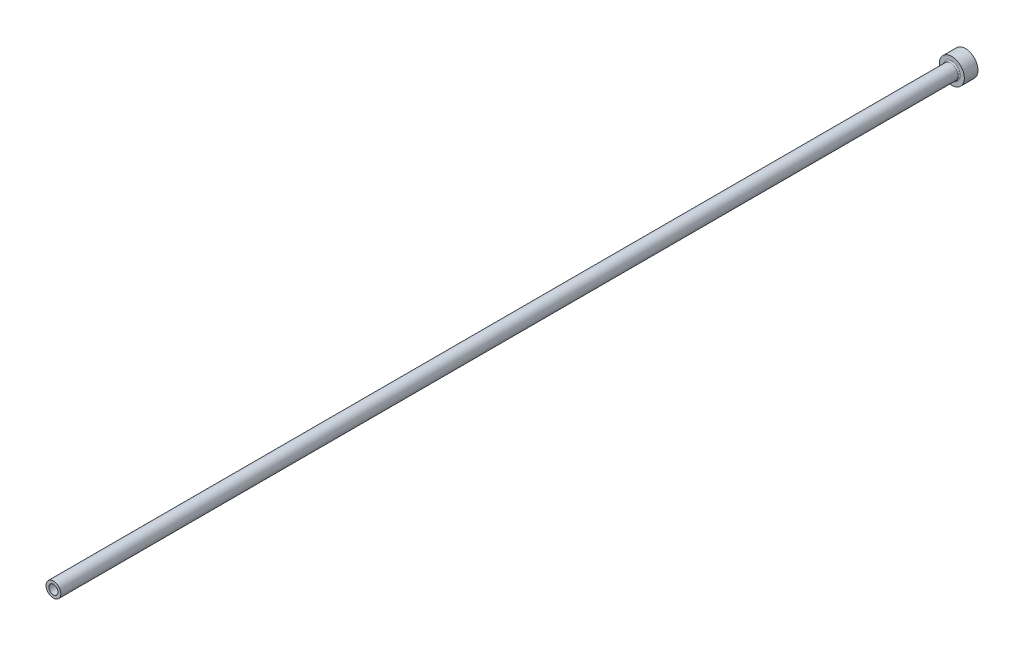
from build123d import *

# Parameters (mm, degrees)
HEAD_FILLET_R          = 0.5
ID_RELIEF_CHAMFER_SIZE = 0.5


with BuildPart() as part:
    # OD FV → Base Revolve (revolve)
    with BuildSketch(Plane(origin=(0, 0, 0), x_dir=(1, 0, 0), z_dir=(0, 1, 0))):
        Polygon((0, -400), (3.25, -400), (3.25, -6), (5.5, -6), (5.5, 0), (0, 0), align=None)
    revolve(axis=Axis((0, 0, 400), (0, 0, -1)))

    # ID FV → Hole (revolve, cut)
    with BuildSketch(Plane(origin=(0, 0, 0), x_dir=(1, 0, 0), z_dir=(0, 1, 0))):
        Polygon((0, -400), (2, -400), (2, -250), (2.25, -249.566987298), (2.25, 0), (0, 0), align=None)
    revolve(axis=Axis((0, 0, 400), (0, 0, -1)), mode=Mode.SUBTRACT)

    # Head Fillet
    head_fillet_edges = [part.edges().sort_by_distance(p)[0] for p in [
        (-3.25, 0, 6),
    ]]
    fillet(head_fillet_edges, radius=HEAD_FILLET_R)

    # ID Relief Chamfer
    id_relief_chamfer_edges = [part.edges().sort_by_distance(p)[0] for p in [
        (-2.25, 0, 0),
    ]]
    chamfer(id_relief_chamfer_edges, length=ID_RELIEF_CHAMFER_SIZE)


solid = part.part
